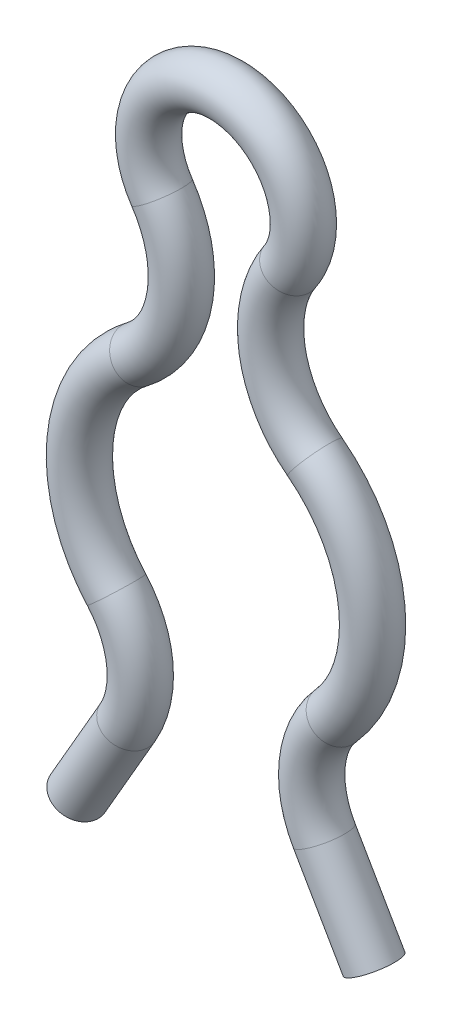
from build123d import *

# Parameters (mm, degrees)
SKETCH3_R = 0.381


with BuildPart() as part:
    # Sweep1: sweep along a path in Sketch2
    with BuildLine(Plane.XY) as sweep1_path:
        Line((-2.405966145, -4.7625), (-1.596097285, -3.359765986))
        ThreePointArc((-1.596097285, -3.359765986), (-1.399853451, -2.442465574), (-1.778, -1.58400365))
        ThreePointArc((-1.778, -1.58400365), (-2.370364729, 0.227426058), (-1.444379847, 1.893176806))
        ThreePointArc((-1.444379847, 1.893176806), (-0.74864088, 3.05319352), (-1.040381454, 4.374018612))
        ThreePointArc((-1.040381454, 4.374018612), (0, 6.3373), (1.040381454, 4.374018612))
        ThreePointArc((1.040381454, 4.374018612), (0.74864088, 3.05319352), (1.444379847, 1.893176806))
        ThreePointArc((1.444379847, 1.893176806), (2.370364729, 0.227426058), (1.778, -1.58400365))
        ThreePointArc((1.778, -1.58400365), (1.399853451, -2.442465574), (1.596097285, -3.359765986))
        Line((1.596097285, -3.359765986), (2.405966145, -4.7625))
    # Sketch3 → Sweep1 (sweep)
    with BuildSketch(Plane(origin=(-2.405966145, -4.7625, 0), x_dir=(0.8660254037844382, -0.5000000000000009, 0), z_dir=(0.5000000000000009, 0.8660254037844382, 0))):
        Circle(SKETCH3_R)
    sweep(path=sweep1_path.line)


solid = part.part
